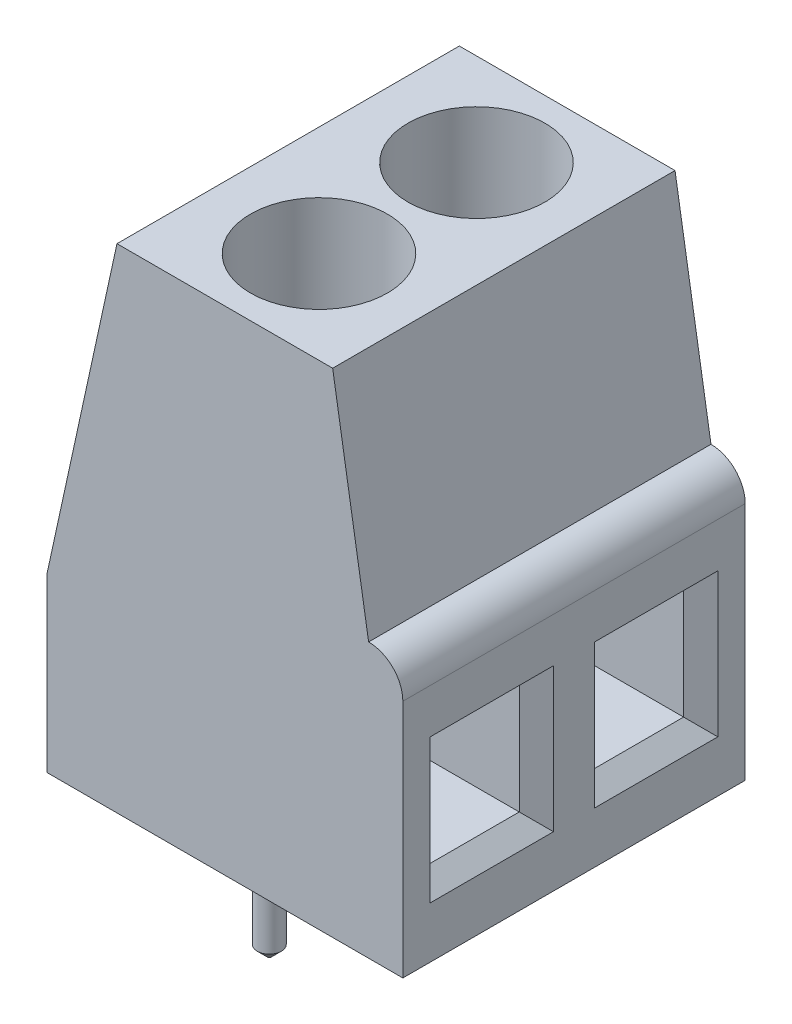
from build123d import *

# Parameters (mm, degrees)
RESSALTO_EXTRUS_O2_DEPTH = 10
ESBO_O4_W                = 2.6
ESBO_O4_H                = 3.2
CORTE_EXTRUS_O1_DEPTH    = 5
CHANFRO2_SIZE            = 0.5
CHANFRO3_SIZE            = 0.5
ESBO_O5_R                = 2
CORTE_EXTRUS_O2_DEPTH    = 3
ESBO_O10_R               = 0.35
RESSALTO_EXTRUS_O5_DEPTH = 3.6
CHANFRO4_SIZE            = 0.3


with BuildPart() as part:
    # Esbo_o2 → Ressalto-extrus_o2 (new body)
    with BuildSketch(Plane.XY):
        with BuildLine():
            Line((0, 0), (10.4, 0))
            Line((10.4, 0), (10.4, 7))
            ThreePointArc((10.4, 7), (10.107106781, 7.707106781), (9.4, 8))
            Line((9.4, 8), (8.35, 14.4))
            Line((8.35, 14.4), (5.2, 14.4))
            Line((5.2, 14.4), (2.05, 14.4))
            Line((2.05, 14.4), (0, 5))
            Line((0, 5), (0, 0))
        make_face()
    extrude(amount=-RESSALTO_EXTRUS_O2_DEPTH)

    # Esbo_o4 → Corte-extrus_o1 (cut)
    with BuildSketch(Plane(origin=(10.4, 0, 0), x_dir=(0, 0, -1), z_dir=(1, 0, 0))):
        with Locations((2.6, 3.6)):
            Rectangle(ESBO_O4_W, ESBO_O4_H)
        with Locations((7.4, 3.6)):
            Rectangle(ESBO_O4_W, ESBO_O4_H)
    extrude(amount=-CORTE_EXTRUS_O1_DEPTH, mode=Mode.SUBTRACT)

    # Chanfro2
    chanfro2_edges = [part.edges().sort_by_distance(p)[0] for p in [
        (10.4, 3.6, -1.3),
        (10.4, 2, -2.6),
        (10.4, 3.6, -3.9),
        (10.4, 5.2, -2.6),
    ]]
    chamfer(chanfro2_edges, length=CHANFRO2_SIZE)

    # Chanfro3
    chanfro3_edges = [part.edges().sort_by_distance(p)[0] for p in [
        (10.4, 3.6, -8.7),
        (10.4, 5.2, -7.4),
        (10.4, 3.6, -6.1),
        (10.4, 2, -7.4),
    ]]
    chamfer(chanfro3_edges, length=CHANFRO3_SIZE)

    # Esbo_o5 → Corte-extrus_o2 (cut)
    with BuildSketch(Plane(origin=(0, 14.4, 0), x_dir=(1, 0, 0), z_dir=(0, 1, 0))):
        with Locations(Location((5.25, 2.7, 0), (0, 0, 270))):
            Circle(ESBO_O5_R)
        with Locations(Location((5.25, 7.3, 0), (0, 0, 270))):
            Circle(ESBO_O5_R)
    extrude(amount=-CORTE_EXTRUS_O2_DEPTH, mode=Mode.SUBTRACT)

    # Esbo_o10 → Ressalto-extrus_o5 (add)
    with BuildSketch(Plane.XZ):
        with Locations(Location((4.3, -2.2, 0), (0, 0, 270))):
            Circle(ESBO_O10_R)
        with Locations(Location((4.3, -7.8, 0), (0, 0, 270))):
            Circle(ESBO_O10_R)
    extrude(amount=RESSALTO_EXTRUS_O5_DEPTH)

    # Chanfro4
    chanfro4_edges = [part.edges().sort_by_distance(p)[0] for p in [
        (4.3, -3.6, -1.85),
        (4.3, -3.6, -7.45),
    ]]
    chamfer(chanfro4_edges, length=CHANFRO4_SIZE)


solid = part.part
